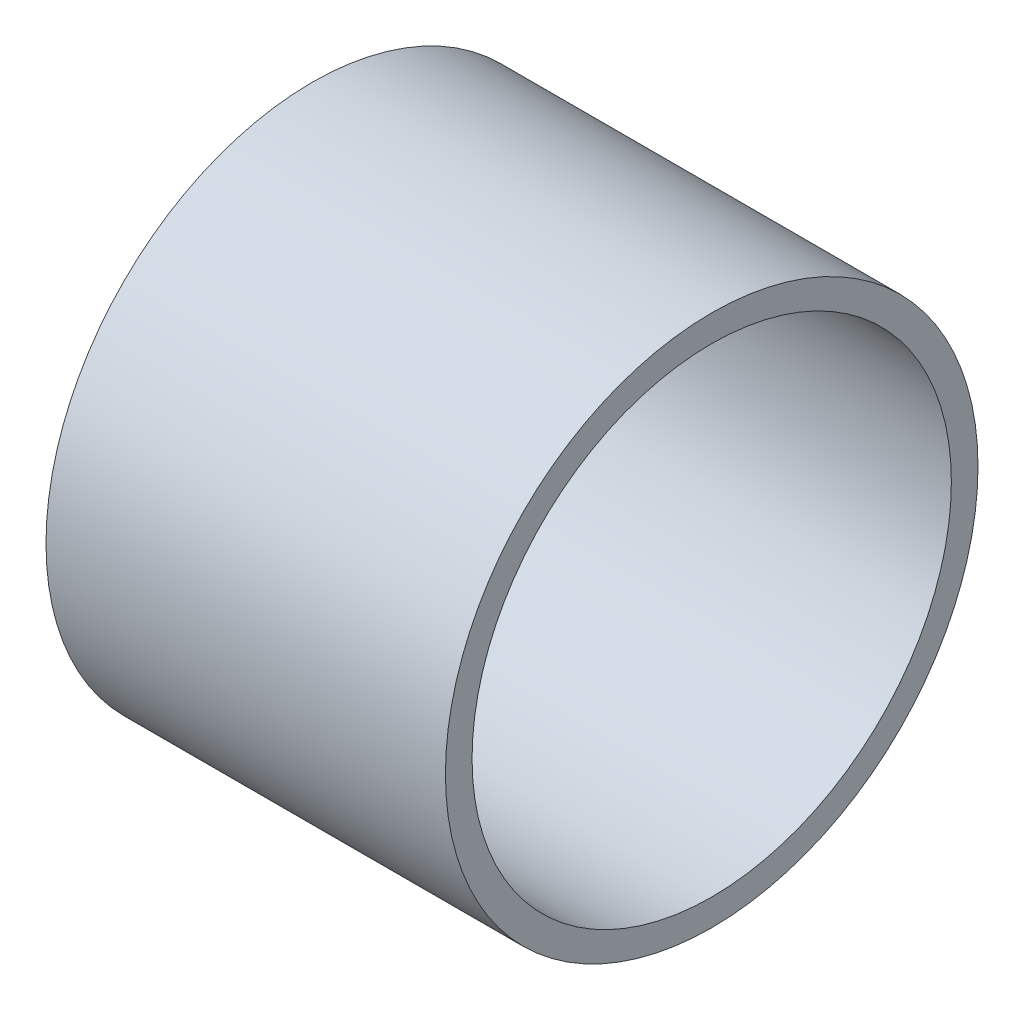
ISO-10303-21;
HEADER;
FILE_DESCRIPTION(('STEP AP214'),'2;1');
FILE_NAME('part.step','',(''),(''),'','','');
FILE_SCHEMA(('AUTOMOTIVE_DESIGN { 1 0 10303 214 1 1 1 1 }'));
ENDSEC;
DATA;
#1=APPLICATION_CONTEXT('core data for automotive mechanical design processes');
#2=APPLICATION_PROTOCOL_DEFINITION('international standard','automotive_design',2000,#1);
#3=PRODUCT_CONTEXT('',#1,'mechanical');
#4=PRODUCT('Part','Part','',(#3));
#5=PRODUCT_RELATED_PRODUCT_CATEGORY('part','',(#4));
#6=PRODUCT_DEFINITION_FORMATION('','',#4);
#7=PRODUCT_DEFINITION_CONTEXT('part definition',#1,'design');
#8=PRODUCT_DEFINITION('design','',#6,#7);
#9=PRODUCT_DEFINITION_SHAPE('','',#8);
#10=(LENGTH_UNIT() NAMED_UNIT(*) SI_UNIT(.MILLI.,.METRE.));
#11=(NAMED_UNIT(*) PLANE_ANGLE_UNIT() SI_UNIT($,.RADIAN.));
#12=(NAMED_UNIT(*) SI_UNIT($,.STERADIAN.) SOLID_ANGLE_UNIT());
#13=UNCERTAINTY_MEASURE_WITH_UNIT(LENGTH_MEASURE(1.E-05),#10,'distance_accuracy_value','');
#14=(GEOMETRIC_REPRESENTATION_CONTEXT(3) GLOBAL_UNCERTAINTY_ASSIGNED_CONTEXT((#13)) GLOBAL_UNIT_ASSIGNED_CONTEXT((#10,
#11,#12)) REPRESENTATION_CONTEXT('',''));
#15=CARTESIAN_POINT('',(0.,0.,0.));
#16=DIRECTION('',(0.,0.,1.));
#17=DIRECTION('',(1.,0.,0.));
#18=AXIS2_PLACEMENT_3D('',#15,#16,#17);
#19=CARTESIAN_POINT('',(60.,0.,0.));
#20=DIRECTION('',(-1.,0.,0.));
#21=DIRECTION('',(0.,0.,1.));
#22=AXIS2_PLACEMENT_3D('',#19,#20,#21);
#23=CYLINDRICAL_SURFACE('',#22,40.);
#24=CARTESIAN_POINT('',(60.,0.,0.));
#25=DIRECTION('',(-1.,0.,0.));
#26=DIRECTION('',(0.,0.,1.));
#27=AXIS2_PLACEMENT_3D('',#24,#25,#26);
#28=CIRCLE('',#27,40.);
#29=CARTESIAN_POINT('',(60.,0.,40.));
#30=VERTEX_POINT('',#29);
#31=EDGE_CURVE('E10',#30,#30,#28,.T.);
#32=ORIENTED_EDGE('',*,*,#31,.T.);
#33=EDGE_LOOP('',(#32));
#34=FACE_BOUND('',#33,.T.);
#35=CARTESIAN_POINT('',(0.,0.,0.));
#36=DIRECTION('',(-1.,0.,0.));
#37=DIRECTION('',(0.,0.,1.));
#38=AXIS2_PLACEMENT_3D('',#35,#36,#37);
#39=CIRCLE('',#38,40.);
#40=CARTESIAN_POINT('',(0.,0.,40.));
#41=VERTEX_POINT('',#40);
#42=EDGE_CURVE('E43',#41,#41,#39,.T.);
#43=ORIENTED_EDGE('',*,*,#42,.F.);
#44=EDGE_LOOP('',(#43));
#45=FACE_BOUND('',#44,.T.);
#46=ADVANCED_FACE('F29',(#34,#45),#23,.T.);
#47=CARTESIAN_POINT('',(60.,40.,0.));
#48=DIRECTION('',(1.,0.,0.));
#49=DIRECTION('',(0.,0.,-1.));
#50=AXIS2_PLACEMENT_3D('',#47,#48,#49);
#51=PLANE('',#50);
#52=CARTESIAN_POINT('',(60.,0.,0.));
#53=DIRECTION('',(-1.,0.,0.));
#54=DIRECTION('',(0.,0.,1.));
#55=AXIS2_PLACEMENT_3D('',#52,#53,#54);
#56=CIRCLE('',#55,36.);
#57=CARTESIAN_POINT('',(60.,0.,36.));
#58=VERTEX_POINT('',#57);
#59=EDGE_CURVE('E35',#58,#58,#56,.T.);
#60=ORIENTED_EDGE('',*,*,#59,.T.);
#61=EDGE_LOOP('',(#60));
#62=FACE_BOUND('',#61,.T.);
#63=ORIENTED_EDGE('',*,*,#31,.F.);
#64=EDGE_LOOP('',(#63));
#65=FACE_BOUND('',#64,.T.);
#66=ADVANCED_FACE('F53',(#62,#65),#51,.T.);
#67=CARTESIAN_POINT('',(60.,0.,0.));
#68=DIRECTION('',(-1.,0.,0.));
#69=DIRECTION('',(0.,0.,1.));
#70=AXIS2_PLACEMENT_3D('',#67,#68,#69);
#71=CYLINDRICAL_SURFACE('',#70,36.);
#72=CARTESIAN_POINT('',(0.,0.,0.));
#73=DIRECTION('',(-1.,0.,0.));
#74=DIRECTION('',(0.,0.,1.));
#75=AXIS2_PLACEMENT_3D('',#72,#73,#74);
#76=CIRCLE('',#75,36.);
#77=CARTESIAN_POINT('',(0.,0.,36.));
#78=VERTEX_POINT('',#77);
#79=EDGE_CURVE('E39',#78,#78,#76,.T.);
#80=ORIENTED_EDGE('',*,*,#79,.T.);
#81=EDGE_LOOP('',(#80));
#82=FACE_BOUND('',#81,.T.);
#83=ORIENTED_EDGE('',*,*,#59,.F.);
#84=EDGE_LOOP('',(#83));
#85=FACE_BOUND('',#84,.T.);
#86=ADVANCED_FACE('F57',(#82,#85),#71,.F.);
#87=CARTESIAN_POINT('',(0.,36.,0.));
#88=DIRECTION('',(-1.,0.,0.));
#89=DIRECTION('',(0.,0.,1.));
#90=AXIS2_PLACEMENT_3D('',#87,#88,#89);
#91=PLANE('',#90);
#92=ORIENTED_EDGE('',*,*,#42,.T.);
#93=EDGE_LOOP('',(#92));
#94=FACE_BOUND('',#93,.T.);
#95=ORIENTED_EDGE('',*,*,#79,.F.);
#96=EDGE_LOOP('',(#95));
#97=FACE_BOUND('',#96,.T.);
#98=ADVANCED_FACE('F49',(#94,#97),#91,.T.);
#99=CLOSED_SHELL('',(#46,#66,#86,#98));
#100=MANIFOLD_SOLID_BREP('B2',#99);
#101=ADVANCED_BREP_SHAPE_REPRESENTATION('',(#18,#100),#14);
#102=SHAPE_DEFINITION_REPRESENTATION(#9,#101);
ENDSEC;
END-ISO-10303-21;
